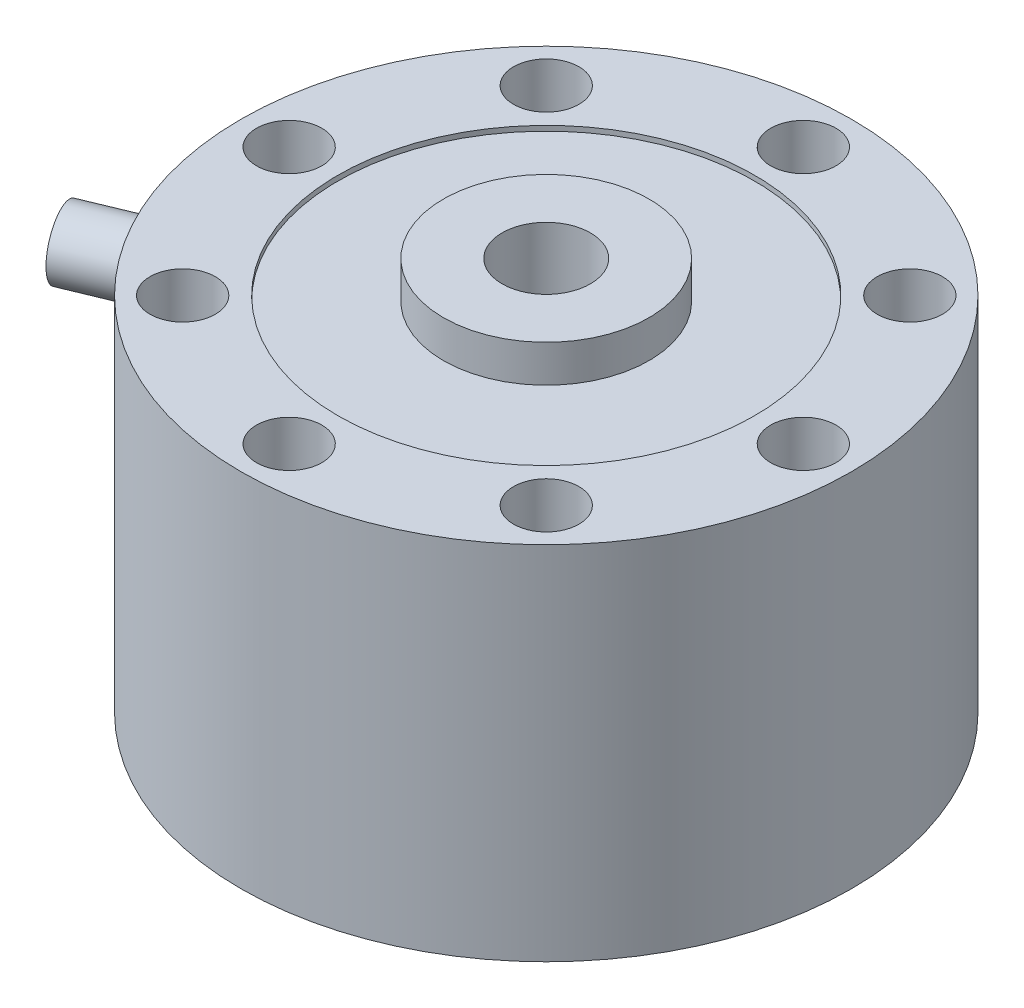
ISO-10303-21;
HEADER;
FILE_DESCRIPTION(('STEP AP214'),'2;1');
FILE_NAME('part.step','',(''),(''),'','','');
FILE_SCHEMA(('AUTOMOTIVE_DESIGN { 1 0 10303 214 1 1 1 1 }'));
ENDSEC;
DATA;
#1=APPLICATION_CONTEXT('core data for automotive mechanical design processes');
#2=APPLICATION_PROTOCOL_DEFINITION('international standard','automotive_design',2000,#1);
#3=PRODUCT_CONTEXT('',#1,'mechanical');
#4=PRODUCT('Part','Part','',(#3));
#5=PRODUCT_RELATED_PRODUCT_CATEGORY('part','',(#4));
#6=PRODUCT_DEFINITION_FORMATION('','',#4);
#7=PRODUCT_DEFINITION_CONTEXT('part definition',#1,'design');
#8=PRODUCT_DEFINITION('design','',#6,#7);
#9=PRODUCT_DEFINITION_SHAPE('','',#8);
#10=(LENGTH_UNIT() NAMED_UNIT(*) SI_UNIT(.MILLI.,.METRE.));
#11=(NAMED_UNIT(*) PLANE_ANGLE_UNIT() SI_UNIT($,.RADIAN.));
#12=(NAMED_UNIT(*) SI_UNIT($,.STERADIAN.) SOLID_ANGLE_UNIT());
#13=UNCERTAINTY_MEASURE_WITH_UNIT(LENGTH_MEASURE(1.E-05),#10,'distance_accuracy_value','');
#14=(GEOMETRIC_REPRESENTATION_CONTEXT(3) GLOBAL_UNCERTAINTY_ASSIGNED_CONTEXT((#13)) GLOBAL_UNIT_ASSIGNED_CONTEXT((#10,
#11,#12)) REPRESENTATION_CONTEXT('',''));
#15=CARTESIAN_POINT('',(0.,0.,0.));
#16=DIRECTION('',(0.,0.,1.));
#17=DIRECTION('',(1.,0.,0.));
#18=AXIS2_PLACEMENT_3D('',#15,#16,#17);
#19=CARTESIAN_POINT('',(0.,71.374,0.));
#20=DIRECTION('',(0.,-1.,0.));
#21=DIRECTION('',(0.,0.,-1.));
#22=AXIS2_PLACEMENT_3D('',#19,#20,#21);
#23=CYLINDRICAL_SURFACE('',#22,60.325);
#24=CARTESIAN_POINT('',(0.,71.374,0.));
#25=DIRECTION('',(0.,1.,0.));
#26=DIRECTION('',(0.,0.,1.));
#27=AXIS2_PLACEMENT_3D('',#24,#25,#26);
#28=CIRCLE('',#27,60.325);
#29=CARTESIAN_POINT('',(0.,71.374,60.325));
#30=VERTEX_POINT('',#29);
#31=EDGE_CURVE('E84',#30,#30,#28,.T.);
#32=ORIENTED_EDGE('',*,*,#31,.F.);
#33=EDGE_LOOP('',(#32));
#34=FACE_BOUND('',#33,.T.);
#35=CARTESIAN_POINT('',(0.,0.,0.));
#36=DIRECTION('',(0.,1.,0.));
#37=DIRECTION('',(0.,0.,1.));
#38=AXIS2_PLACEMENT_3D('',#35,#36,#37);
#39=CIRCLE('',#38,60.325);
#40=CARTESIAN_POINT('',(0.,0.,60.325));
#41=VERTEX_POINT('',#40);
#42=EDGE_CURVE('E83',#41,#41,#39,.T.);
#43=ORIENTED_EDGE('',*,*,#42,.T.);
#44=EDGE_LOOP('',(#43));
#45=FACE_BOUND('',#44,.T.);
#46=CARTESIAN_POINT('',(-57.853442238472,60.718554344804,17.0904899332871));
#47=CARTESIAN_POINT('',(-57.8534424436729,60.5406812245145,17.090488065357));
#48=CARTESIAN_POINT('',(-57.8513134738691,60.3628354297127,17.097700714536));
#49=CARTESIAN_POINT('',(-57.8427971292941,60.008356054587,17.1264906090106));
#50=CARTESIAN_POINT('',(-57.8364087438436,59.8317227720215,17.1480712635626));
#51=CARTESIAN_POINT('',(-57.819366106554,59.480849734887,17.2054473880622));
#52=CARTESIAN_POINT('',(-57.808708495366,59.3066119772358,17.241254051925));
#53=CARTESIAN_POINT('',(-57.7831247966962,58.9618431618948,17.3268031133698));
#54=CARTESIAN_POINT('',(-57.7681971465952,58.7913134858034,17.3765506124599));
#55=CARTESIAN_POINT('',(-57.7340971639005,58.4554030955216,17.4895146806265));
#56=CARTESIAN_POINT('',(-57.7149290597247,58.2900174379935,17.5527178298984));
#57=CARTESIAN_POINT('',(-57.6723427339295,57.9653209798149,17.6921400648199));
#58=CARTESIAN_POINT('',(-57.6489229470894,57.806012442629,17.7683639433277));
#59=CARTESIAN_POINT('',(-57.5978721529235,57.494739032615,17.9331587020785));
#60=CARTESIAN_POINT('',(-57.570243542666,57.3427700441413,18.0217225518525));
#61=CARTESIAN_POINT('',(-57.5107863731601,57.047083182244,18.2105704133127));
#62=CARTESIAN_POINT('',(-57.4789562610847,56.9033683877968,18.3108587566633));
#63=CARTESIAN_POINT('',(-57.4110437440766,56.624804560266,18.5226911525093));
#64=CARTESIAN_POINT('',(-57.3749480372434,56.4899854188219,18.634270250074));
#65=CARTESIAN_POINT('',(-57.29864274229,56.2306146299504,18.8675974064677));
#66=CARTESIAN_POINT('',(-57.2584316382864,56.1060667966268,18.9893492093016));
#67=CARTESIAN_POINT('',(-57.1740169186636,55.8682066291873,19.2420151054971));
#68=CARTESIAN_POINT('',(-57.1298145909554,55.7548906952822,19.3729262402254));
#69=CARTESIAN_POINT('',(-57.0375175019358,55.540207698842,19.6430036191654));
#70=CARTESIAN_POINT('',(-56.9894213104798,55.4388450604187,19.782172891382));
#71=CARTESIAN_POINT('',(-56.8894161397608,55.2486495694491,20.0679573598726));
#72=CARTESIAN_POINT('',(-56.8374998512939,55.159841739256,20.2145866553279));
#73=CARTESIAN_POINT('',(-56.7301262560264,54.9956004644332,20.5139880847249));
#74=CARTESIAN_POINT('',(-56.6746676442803,54.9201719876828,20.6667624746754));
#75=CARTESIAN_POINT('',(-56.5604931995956,54.7833030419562,20.9772148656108));
#76=CARTESIAN_POINT('',(-56.5017786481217,54.721857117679,21.1348909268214));
#77=CARTESIAN_POINT('',(-56.3813746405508,54.6133466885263,21.4540302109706));
#78=CARTESIAN_POINT('',(-56.3196840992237,54.566287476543,21.6154948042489));
#79=CARTESIAN_POINT('',(-56.1311619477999,54.4476193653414,22.1024535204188));
#80=CARTESIAN_POINT('',(-56.0003259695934,54.3978559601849,22.4320242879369));
#81=CARTESIAN_POINT('',(-55.7315722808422,54.3585339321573,23.091655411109));
#82=CARTESIAN_POINT('',(-55.5936547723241,54.3689735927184,23.4217157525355));
#83=CARTESIAN_POINT('',(-55.3152468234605,54.4495044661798,24.0718422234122));
#84=CARTESIAN_POINT('',(-55.174768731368,54.5193593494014,24.3919427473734));
#85=CARTESIAN_POINT('',(-54.8952635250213,54.7163903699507,25.0146408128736));
#86=CARTESIAN_POINT('',(-54.7562364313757,54.843567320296,25.3172381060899));
#87=CARTESIAN_POINT('',(-54.4842323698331,55.1518844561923,25.897432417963));
#88=CARTESIAN_POINT('',(-54.3512676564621,55.3331288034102,26.1749798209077));
#89=CARTESIAN_POINT('',(-54.0966622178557,55.7443617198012,26.6972151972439));
#90=CARTESIAN_POINT('',(-53.9750218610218,55.9743518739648,26.9419021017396));
#91=CARTESIAN_POINT('',(-53.7473390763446,56.4778758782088,27.3933116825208));
#92=CARTESIAN_POINT('',(-53.6413751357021,56.7516154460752,27.5998445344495));
#93=CARTESIAN_POINT('',(-53.4502151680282,57.3341559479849,27.9682559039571));
#94=CARTESIAN_POINT('',(-53.3650191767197,57.6429569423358,28.1301343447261));
#95=CARTESIAN_POINT('',(-53.2191257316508,58.2870172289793,28.4051869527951));
#96=CARTESIAN_POINT('',(-53.1584343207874,58.6222830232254,28.51834910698));
#97=CARTESIAN_POINT('',(-53.0643557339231,59.3096746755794,28.6930254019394));
#98=CARTESIAN_POINT('',(-53.0309676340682,59.661799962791,28.7545412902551));
#99=CARTESIAN_POINT('',(-52.9931476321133,60.3711096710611,28.824182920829));
#100=CARTESIAN_POINT('',(-52.9885778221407,60.7282617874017,28.8325629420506));
#101=CARTESIAN_POINT('',(-53.008240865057,61.4390712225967,28.7963961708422));
#102=CARTESIAN_POINT('',(-53.0324732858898,61.7927285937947,28.751850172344));
#103=CARTESIAN_POINT('',(-53.1085194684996,62.4856663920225,28.6111357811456));
#104=CARTESIAN_POINT('',(-53.1602685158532,62.8249785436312,28.5150885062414));
#105=CARTESIAN_POINT('',(-53.2889546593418,63.4805814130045,28.273866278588));
#106=CARTESIAN_POINT('',(-53.3658923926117,63.7968715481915,28.1286900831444));
#107=CARTESIAN_POINT('',(-53.5419048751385,64.3987615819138,27.7921949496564));
#108=CARTESIAN_POINT('',(-53.641061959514,64.6842413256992,27.6007041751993));
#109=CARTESIAN_POINT('',(-53.8571365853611,65.2151868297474,27.1766616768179));
#110=CARTESIAN_POINT('',(-53.9740546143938,65.4606514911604,26.9441088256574));
#111=CARTESIAN_POINT('',(-54.2214116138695,65.9055951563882,26.4428145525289));
#112=CARTESIAN_POINT('',(-54.3519028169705,66.1048862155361,26.1739320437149));
#113=CARTESIAN_POINT('',(-54.6209722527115,66.4505290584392,25.6076766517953));
#114=CARTESIAN_POINT('',(-54.7595503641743,66.596881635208,25.310304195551));
#115=CARTESIAN_POINT('',(-55.0394552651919,66.832182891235,24.6957040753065));
#116=CARTESIAN_POINT('',(-55.1807760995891,66.9212441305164,24.3785166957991));
#117=CARTESIAN_POINT('',(-55.4617710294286,67.0397768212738,23.7322852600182));
#118=CARTESIAN_POINT('',(-55.6014451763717,67.0692501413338,23.4032415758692));
#119=CARTESIAN_POINT('',(-55.8060248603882,67.0681878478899,22.9090630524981));
#120=CARTESIAN_POINT('',(-55.873273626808,67.0603456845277,22.7445463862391));
#121=CARTESIAN_POINT('',(-56.0058369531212,67.0297929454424,22.4161346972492));
#122=CARTESIAN_POINT('',(-56.071152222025,67.007087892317,22.2522394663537));
#123=CARTESIAN_POINT('',(-56.1994532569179,66.9469579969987,21.9261901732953));
#124=CARTESIAN_POINT('',(-56.2624381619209,66.9095277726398,21.764036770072));
#125=CARTESIAN_POINT('',(-56.3856666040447,66.8202408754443,21.4427565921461));
#126=CARTESIAN_POINT('',(-56.4459111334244,66.7683894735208,21.283628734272));
#127=CARTESIAN_POINT('',(-56.563369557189,66.6506182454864,20.9694773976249));
#128=CARTESIAN_POINT('',(-56.6205828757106,66.5846957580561,20.8144547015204));
#129=CARTESIAN_POINT('',(-56.7316709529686,66.4392890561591,20.5097398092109));
#130=CARTESIAN_POINT('',(-56.7855469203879,66.3598097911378,20.3600456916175));
#131=CARTESIAN_POINT('',(-56.8897712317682,66.1878081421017,20.0669816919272));
#132=CARTESIAN_POINT('',(-56.9401183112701,66.0952811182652,19.9236140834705));
#133=CARTESIAN_POINT('',(-57.0370579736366,65.8978951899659,19.6443753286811));
#134=CARTESIAN_POINT('',(-57.0836519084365,65.7930407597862,19.5085014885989));
#135=CARTESIAN_POINT('',(-57.1731804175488,65.5711517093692,19.2445470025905));
#136=CARTESIAN_POINT('',(-57.2160954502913,65.4540585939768,19.1165088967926));
#137=CARTESIAN_POINT('',(-57.2978704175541,65.2090001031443,18.8699902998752));
#138=CARTESIAN_POINT('',(-57.3367318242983,65.0810387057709,18.7515063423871));
#139=CARTESIAN_POINT('',(-57.4103524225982,64.8150222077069,18.524882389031));
#140=CARTESIAN_POINT('',(-57.4451091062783,64.6769610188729,18.4167487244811));
#141=CARTESIAN_POINT('',(-57.5104177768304,64.3918339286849,18.2117830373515));
#142=CARTESIAN_POINT('',(-57.5409713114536,64.2447713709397,18.1149468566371));
#143=CARTESIAN_POINT('',(-57.5979360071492,63.9421466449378,17.933000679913));
#144=CARTESIAN_POINT('',(-57.6243337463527,63.7865590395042,17.8479287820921));
#145=CARTESIAN_POINT('',(-57.6728328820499,63.4684724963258,17.6905836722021));
#146=CARTESIAN_POINT('',(-57.6949358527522,63.305976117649,17.6183057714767));
#147=CARTESIAN_POINT('',(-57.7348249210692,62.9753021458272,17.4871471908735));
#148=CARTESIAN_POINT('',(-57.7526145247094,62.8071292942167,17.4282556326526));
#149=CARTESIAN_POINT('',(-57.7838866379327,62.4662348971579,17.32428958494));
#150=CARTESIAN_POINT('',(-57.7973701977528,62.2935144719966,17.2792117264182));
#151=CARTESIAN_POINT('',(-57.8236128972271,61.8895914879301,17.1912241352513));
#152=CARTESIAN_POINT('',(-57.834799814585,61.6571387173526,17.1534905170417));
#153=CARTESIAN_POINT('',(-57.8497143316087,61.1892927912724,17.1031247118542));
#154=CARTESIAN_POINT('',(-57.853441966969,60.9538996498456,17.09049240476));
#155=CARTESIAN_POINT('',(-57.853442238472,60.718554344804,17.0904899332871));
#156=B_SPLINE_CURVE_WITH_KNOTS('',3,(#46,#47,#48,#49,#50,#51,#52,#53,#54,#55,#56,#57,#58,#59,
#60,#61,#62,#63,#64,#65,#66,#67,#68,#69,#70,#71,#72,#73,#74,#75,#76,#77,#78,#79,#80,#81,#82,#83,
#84,#85,#86,#87,#88,#89,#90,#91,#92,#93,#94,#95,#96,#97,#98,#99,#100,#101,#102,#103,#104,#105,
#106,#107,#108,#109,#110,#111,#112,#113,#114,#115,#116,#117,#118,#119,#120,#121,#122,#123,#124,
#125,#126,#127,#128,#129,#130,#131,#132,#133,#134,#135,#136,#137,#138,#139,#140,#141,#142,#143,
#144,#145,#146,#147,#148,#149,#150,#151,#152,#153,#154,#155),.UNSPECIFIED.,.T.,.F.,(4,2,2,2,2,2,
2,2,2,2,2,2,2,2,2,2,2,2,2,2,2,2,2,2,2,2,2,2,2,2,2,2,2,2,2,2,2,2,2,2,2,2,2,2,2,2,2,2,2,2,2,2,2,2,
4),(0.,0.533413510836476,1.06695363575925,1.60091441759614,2.1350708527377,2.66869702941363,
3.20252005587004,3.73604018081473,4.26975804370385,4.80518650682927,5.34081290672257,
5.8762670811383,6.41191881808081,6.94862352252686,7.48552709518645,8.02222083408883,
8.55911178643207,9.62773556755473,10.6963288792,11.7606915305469,12.8250692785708,
13.8915109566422,14.9579873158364,16.0296345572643,17.1012836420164,18.1731968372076,
19.2450737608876,20.3118173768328,21.3785449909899,22.4427748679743,23.5070316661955,
24.57529933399,25.6435963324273,26.71616818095,27.7887239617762,28.8591660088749,
29.929574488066,30.4627659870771,30.9957594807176,31.528947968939,32.0619418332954,
32.5950365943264,33.1279371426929,33.661027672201,34.1939253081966,34.7294977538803,
35.2648750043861,35.8005776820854,36.3360825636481,36.873282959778,37.4102860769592,
37.9468512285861,38.4832854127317,39.1890523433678,39.8948158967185),.UNSPECIFIED.);
#157=CARTESIAN_POINT('',(-57.853442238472,60.718554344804,17.0904899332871));
#158=VERTEX_POINT('',#157);
#159=EDGE_CURVE('E11',#158,#158,#156,.T.);
#160=ORIENTED_EDGE('',*,*,#159,.F.);
#161=EDGE_LOOP('',(#160));
#162=FACE_BOUND('',#161,.T.);
#163=ADVANCED_FACE('F37',(#34,#45,#162),#23,.T.);
#164=CARTESIAN_POINT('',(-35.9210244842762,-1.27000000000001,-35.9210244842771));
#165=DIRECTION('',(0.,1.,0.));
#166=DIRECTION('',(0.,0.,1.));
#167=AXIS2_PLACEMENT_3D('',#164,#165,#166);
#168=CYLINDRICAL_SURFACE('',#167,4.3561);
#169=CARTESIAN_POINT('',(-35.9210244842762,0.,-35.9210244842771));
#170=DIRECTION('',(0.,1.,0.));
#171=DIRECTION('',(0.,0.,1.));
#172=AXIS2_PLACEMENT_3D('',#169,#170,#171);
#173=CIRCLE('',#172,4.3561);
#174=CARTESIAN_POINT('',(-35.9210244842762,0.,-31.564924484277));
#175=VERTEX_POINT('',#174);
#176=EDGE_CURVE('E98',#175,#175,#173,.T.);
#177=ORIENTED_EDGE('',*,*,#176,.F.);
#178=EDGE_LOOP('',(#177));
#179=FACE_BOUND('',#178,.T.);
#180=CARTESIAN_POINT('',(-35.9210244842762,61.214,-35.9210244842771));
#181=DIRECTION('',(0.,1.,0.));
#182=DIRECTION('',(0.,0.,1.));
#183=AXIS2_PLACEMENT_3D('',#180,#181,#182);
#184=CIRCLE('',#183,4.3561);
#185=CARTESIAN_POINT('',(-35.9210244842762,61.214,-31.564924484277));
#186=VERTEX_POINT('',#185);
#187=EDGE_CURVE('E115',#186,#186,#184,.F.);
#188=ORIENTED_EDGE('',*,*,#187,.F.);
#189=EDGE_LOOP('',(#188));
#190=FACE_BOUND('',#189,.T.);
#191=ADVANCED_FACE('F180',(#179,#190),#168,.F.);
#192=CARTESIAN_POINT('',(-50.8,-1.27000000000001,-5.32101756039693E-13));
#193=DIRECTION('',(0.,1.,0.));
#194=DIRECTION('',(0.,0.,1.));
#195=AXIS2_PLACEMENT_3D('',#192,#193,#194);
#196=CYLINDRICAL_SURFACE('',#195,4.3561);
#197=CARTESIAN_POINT('',(-50.8,0.,-5.32101756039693E-13));
#198=DIRECTION('',(0.,1.,0.));
#199=DIRECTION('',(0.,0.,1.));
#200=AXIS2_PLACEMENT_3D('',#197,#198,#199);
#201=CIRCLE('',#200,4.3561);
#202=CARTESIAN_POINT('',(-50.8,0.,4.35609999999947));
#203=VERTEX_POINT('',#202);
#204=EDGE_CURVE('E130',#203,#203,#201,.T.);
#205=ORIENTED_EDGE('',*,*,#204,.F.);
#206=EDGE_LOOP('',(#205));
#207=FACE_BOUND('',#206,.T.);
#208=CARTESIAN_POINT('',(-50.8,61.214,-5.32101756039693E-13));
#209=DIRECTION('',(0.,1.,0.));
#210=DIRECTION('',(0.,0.,1.));
#211=AXIS2_PLACEMENT_3D('',#208,#209,#210);
#212=CIRCLE('',#211,4.3561);
#213=CARTESIAN_POINT('',(-50.8,61.214,4.35609999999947));
#214=VERTEX_POINT('',#213);
#215=EDGE_CURVE('E113',#214,#214,#212,.F.);
#216=ORIENTED_EDGE('',*,*,#215,.F.);
#217=EDGE_LOOP('',(#216));
#218=FACE_BOUND('',#217,.T.);
#219=ADVANCED_FACE('F185',(#207,#218),#196,.F.);
#220=CARTESIAN_POINT('',(-35.9210244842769,-1.27000000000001,35.9210244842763));
#221=DIRECTION('',(0.,1.,0.));
#222=DIRECTION('',(0.,0.,1.));
#223=AXIS2_PLACEMENT_3D('',#220,#221,#222);
#224=CYLINDRICAL_SURFACE('',#223,4.3561);
#225=CARTESIAN_POINT('',(-35.9210244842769,0.,35.9210244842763));
#226=DIRECTION('',(0.,1.,0.));
#227=DIRECTION('',(0.,0.,1.));
#228=AXIS2_PLACEMENT_3D('',#225,#226,#227);
#229=CIRCLE('',#228,4.3561);
#230=CARTESIAN_POINT('',(-35.9210244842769,0.,40.2771244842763));
#231=VERTEX_POINT('',#230);
#232=EDGE_CURVE('E133',#231,#231,#229,.T.);
#233=ORIENTED_EDGE('',*,*,#232,.F.);
#234=EDGE_LOOP('',(#233));
#235=FACE_BOUND('',#234,.T.);
#236=CARTESIAN_POINT('',(-35.9210244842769,61.214,35.9210244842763));
#237=DIRECTION('',(0.,1.,0.));
#238=DIRECTION('',(0.,0.,1.));
#239=AXIS2_PLACEMENT_3D('',#236,#237,#238);
#240=CIRCLE('',#239,4.3561);
#241=CARTESIAN_POINT('',(-35.9210244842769,61.214,40.2771244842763));
#242=VERTEX_POINT('',#241);
#243=EDGE_CURVE('E110',#242,#242,#240,.F.);
#244=ORIENTED_EDGE('',*,*,#243,.F.);
#245=EDGE_LOOP('',(#244));
#246=FACE_BOUND('',#245,.T.);
#247=ADVANCED_FACE('F286',(#235,#246),#224,.F.);
#248=CARTESIAN_POINT('',(0.,-1.27000000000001,50.8));
#249=DIRECTION('',(0.,1.,0.));
#250=DIRECTION('',(0.,0.,1.));
#251=AXIS2_PLACEMENT_3D('',#248,#249,#250);
#252=CYLINDRICAL_SURFACE('',#251,4.3561);
#253=CARTESIAN_POINT('',(0.,0.,50.8));
#254=DIRECTION('',(0.,1.,0.));
#255=DIRECTION('',(0.,0.,1.));
#256=AXIS2_PLACEMENT_3D('',#253,#254,#255);
#257=CIRCLE('',#256,4.3561);
#258=CARTESIAN_POINT('',(0.,0.,55.1561));
#259=VERTEX_POINT('',#258);
#260=EDGE_CURVE('E136',#259,#259,#257,.T.);
#261=ORIENTED_EDGE('',*,*,#260,.F.);
#262=EDGE_LOOP('',(#261));
#263=FACE_BOUND('',#262,.T.);
#264=CARTESIAN_POINT('',(0.,61.214,50.8));
#265=DIRECTION('',(0.,1.,0.));
#266=DIRECTION('',(0.,0.,1.));
#267=AXIS2_PLACEMENT_3D('',#264,#265,#266);
#268=CIRCLE('',#267,4.3561);
#269=CARTESIAN_POINT('',(0.,61.214,55.1561));
#270=VERTEX_POINT('',#269);
#271=EDGE_CURVE('E107',#270,#270,#268,.F.);
#272=ORIENTED_EDGE('',*,*,#271,.F.);
#273=EDGE_LOOP('',(#272));
#274=FACE_BOUND('',#273,.T.);
#275=ADVANCED_FACE('F282',(#263,#274),#252,.F.);
#276=CARTESIAN_POINT('',(35.9210244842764,-1.27000000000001,35.9210244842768));
#277=DIRECTION('',(0.,1.,0.));
#278=DIRECTION('',(0.,0.,1.));
#279=AXIS2_PLACEMENT_3D('',#276,#277,#278);
#280=CYLINDRICAL_SURFACE('',#279,4.3561);
#281=CARTESIAN_POINT('',(35.9210244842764,0.,35.9210244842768));
#282=DIRECTION('',(0.,1.,0.));
#283=DIRECTION('',(0.,0.,1.));
#284=AXIS2_PLACEMENT_3D('',#281,#282,#283);
#285=CIRCLE('',#284,4.3561);
#286=CARTESIAN_POINT('',(35.9210244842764,0.,40.2771244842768));
#287=VERTEX_POINT('',#286);
#288=EDGE_CURVE('E139',#287,#287,#285,.T.);
#289=ORIENTED_EDGE('',*,*,#288,.F.);
#290=EDGE_LOOP('',(#289));
#291=FACE_BOUND('',#290,.T.);
#292=CARTESIAN_POINT('',(35.9210244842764,61.214,35.9210244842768));
#293=DIRECTION('',(0.,1.,0.));
#294=DIRECTION('',(0.,0.,1.));
#295=AXIS2_PLACEMENT_3D('',#292,#293,#294);
#296=CIRCLE('',#295,4.3561);
#297=CARTESIAN_POINT('',(35.9210244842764,61.214,40.2771244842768));
#298=VERTEX_POINT('',#297);
#299=EDGE_CURVE('E103',#298,#298,#296,.F.);
#300=ORIENTED_EDGE('',*,*,#299,.F.);
#301=EDGE_LOOP('',(#300));
#302=FACE_BOUND('',#301,.T.);
#303=ADVANCED_FACE('F278',(#291,#302),#280,.F.);
#304=CARTESIAN_POINT('',(50.8,-1.27000000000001,1.77367252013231E-13));
#305=DIRECTION('',(0.,1.,0.));
#306=DIRECTION('',(0.,0.,1.));
#307=AXIS2_PLACEMENT_3D('',#304,#305,#306);
#308=CYLINDRICAL_SURFACE('',#307,4.3561);
#309=CARTESIAN_POINT('',(50.8,0.,1.77367252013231E-13));
#310=DIRECTION('',(0.,1.,0.));
#311=DIRECTION('',(0.,0.,1.));
#312=AXIS2_PLACEMENT_3D('',#309,#310,#311);
#313=CIRCLE('',#312,4.3561);
#314=CARTESIAN_POINT('',(50.8,0.,4.35610000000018));
#315=VERTEX_POINT('',#314);
#316=EDGE_CURVE('E142',#315,#315,#313,.T.);
#317=ORIENTED_EDGE('',*,*,#316,.F.);
#318=EDGE_LOOP('',(#317));
#319=FACE_BOUND('',#318,.T.);
#320=CARTESIAN_POINT('',(50.8,61.214,1.77367252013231E-13));
#321=DIRECTION('',(0.,1.,0.));
#322=DIRECTION('',(0.,0.,1.));
#323=AXIS2_PLACEMENT_3D('',#320,#321,#322);
#324=CIRCLE('',#323,4.3561);
#325=CARTESIAN_POINT('',(50.8,61.214,4.35610000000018));
#326=VERTEX_POINT('',#325);
#327=EDGE_CURVE('E100',#326,#326,#324,.F.);
#328=ORIENTED_EDGE('',*,*,#327,.F.);
#329=EDGE_LOOP('',(#328));
#330=FACE_BOUND('',#329,.T.);
#331=ADVANCED_FACE('F275',(#319,#330),#308,.F.);
#332=CARTESIAN_POINT('',(35.9210244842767,-1.27000000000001,-35.9210244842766));
#333=DIRECTION('',(0.,1.,0.));
#334=DIRECTION('',(0.,0.,1.));
#335=AXIS2_PLACEMENT_3D('',#332,#333,#334);
#336=CYLINDRICAL_SURFACE('',#335,4.3561);
#337=CARTESIAN_POINT('',(35.9210244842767,0.,-35.9210244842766));
#338=DIRECTION('',(0.,1.,0.));
#339=DIRECTION('',(0.,0.,1.));
#340=AXIS2_PLACEMENT_3D('',#337,#338,#339);
#341=CIRCLE('',#340,4.3561);
#342=CARTESIAN_POINT('',(35.9210244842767,0.,-31.5649244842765));
#343=VERTEX_POINT('',#342);
#344=EDGE_CURVE('E145',#343,#343,#341,.T.);
#345=ORIENTED_EDGE('',*,*,#344,.F.);
#346=EDGE_LOOP('',(#345));
#347=FACE_BOUND('',#346,.T.);
#348=CARTESIAN_POINT('',(35.9210244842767,61.214,-35.9210244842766));
#349=DIRECTION('',(0.,1.,0.));
#350=DIRECTION('',(0.,0.,1.));
#351=AXIS2_PLACEMENT_3D('',#348,#349,#350);
#352=CIRCLE('',#351,4.3561);
#353=CARTESIAN_POINT('',(35.9210244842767,61.214,-31.5649244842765));
#354=VERTEX_POINT('',#353);
#355=EDGE_CURVE('E95',#354,#354,#352,.F.);
#356=ORIENTED_EDGE('',*,*,#355,.F.);
#357=EDGE_LOOP('',(#356));
#358=FACE_BOUND('',#357,.T.);
#359=ADVANCED_FACE('F161',(#347,#358),#336,.F.);
#360=CARTESIAN_POINT('',(0.,-1.27000000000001,-50.8));
#361=DIRECTION('',(0.,1.,0.));
#362=DIRECTION('',(0.,0.,1.));
#363=AXIS2_PLACEMENT_3D('',#360,#361,#362);
#364=CYLINDRICAL_SURFACE('',#363,4.3561);
#365=CARTESIAN_POINT('',(0.,0.,-50.8));
#366=DIRECTION('',(0.,1.,0.));
#367=DIRECTION('',(0.,0.,1.));
#368=AXIS2_PLACEMENT_3D('',#365,#366,#367);
#369=CIRCLE('',#368,4.3561);
#370=CARTESIAN_POINT('',(0.,0.,-46.4439));
#371=VERTEX_POINT('',#370);
#372=EDGE_CURVE('E71',#371,#371,#369,.T.);
#373=ORIENTED_EDGE('',*,*,#372,.F.);
#374=EDGE_LOOP('',(#373));
#375=FACE_BOUND('',#374,.T.);
#376=CARTESIAN_POINT('',(0.,61.214,-50.8));
#377=DIRECTION('',(0.,1.,0.));
#378=DIRECTION('',(0.,0.,1.));
#379=AXIS2_PLACEMENT_3D('',#376,#377,#378);
#380=CIRCLE('',#379,4.3561);
#381=CARTESIAN_POINT('',(0.,61.214,-46.4439));
#382=VERTEX_POINT('',#381);
#383=EDGE_CURVE('E91',#382,#382,#380,.F.);
#384=ORIENTED_EDGE('',*,*,#383,.F.);
#385=EDGE_LOOP('',(#384));
#386=FACE_BOUND('',#385,.T.);
#387=ADVANCED_FACE('F158',(#375,#386),#364,.F.);
#388=CARTESIAN_POINT('',(0.,0.,0.));
#389=DIRECTION('',(0.,1.,0.));
#390=DIRECTION('',(0.,0.,1.));
#391=AXIS2_PLACEMENT_3D('',#388,#389,#390);
#392=PLANE('',#391);
#393=ORIENTED_EDGE('',*,*,#316,.T.);
#394=EDGE_LOOP('',(#393));
#395=FACE_BOUND('',#394,.T.);
#396=ORIENTED_EDGE('',*,*,#288,.T.);
#397=EDGE_LOOP('',(#396));
#398=FACE_BOUND('',#397,.T.);
#399=ORIENTED_EDGE('',*,*,#260,.T.);
#400=EDGE_LOOP('',(#399));
#401=FACE_BOUND('',#400,.T.);
#402=ORIENTED_EDGE('',*,*,#232,.T.);
#403=EDGE_LOOP('',(#402));
#404=FACE_BOUND('',#403,.T.);
#405=ORIENTED_EDGE('',*,*,#204,.T.);
#406=EDGE_LOOP('',(#405));
#407=FACE_BOUND('',#406,.T.);
#408=ORIENTED_EDGE('',*,*,#176,.T.);
#409=EDGE_LOOP('',(#408));
#410=FACE_BOUND('',#409,.T.);
#411=ORIENTED_EDGE('',*,*,#344,.T.);
#412=EDGE_LOOP('',(#411));
#413=FACE_BOUND('',#412,.T.);
#414=ORIENTED_EDGE('',*,*,#372,.T.);
#415=EDGE_LOOP('',(#414));
#416=FACE_BOUND('',#415,.T.);
#417=ORIENTED_EDGE('',*,*,#42,.F.);
#418=EDGE_LOOP('',(#417));
#419=FACE_BOUND('',#418,.T.);
#420=CARTESIAN_POINT('',(0.,0.,0.));
#421=DIRECTION('',(0.,1.,0.));
#422=DIRECTION('',(0.,0.,1.));
#423=AXIS2_PLACEMENT_3D('',#420,#421,#422);
#424=CIRCLE('',#423,20.32);
#425=CARTESIAN_POINT('',(0.,0.,20.32));
#426=VERTEX_POINT('',#425);
#427=EDGE_CURVE('E48',#426,#426,#424,.F.);
#428=ORIENTED_EDGE('',*,*,#427,.F.);
#429=EDGE_LOOP('',(#428));
#430=FACE_BOUND('',#429,.T.);
#431=ADVANCED_FACE('F155',(#395,#398,#401,#404,#407,#410,#413,#416,#419,#430),#392,.F.);
#432=CARTESIAN_POINT('',(0.,71.374,0.));
#433=DIRECTION('',(0.,1.,0.));
#434=DIRECTION('',(0.,0.,1.));
#435=AXIS2_PLACEMENT_3D('',#432,#433,#434);
#436=PLANE('',#435);
#437=CARTESIAN_POINT('',(0.,71.374,0.));
#438=DIRECTION('',(0.,1.,0.));
#439=DIRECTION('',(0.,0.,1.));
#440=AXIS2_PLACEMENT_3D('',#437,#438,#439);
#441=CIRCLE('',#440,41.1700045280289);
#442=CARTESIAN_POINT('',(0.,71.374,41.1700045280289));
#443=VERTEX_POINT('',#442);
#444=EDGE_CURVE('E338',#443,#443,#441,.T.);
#445=ORIENTED_EDGE('',*,*,#444,.F.);
#446=EDGE_LOOP('',(#445));
#447=FACE_BOUND('',#446,.T.);
#448=CARTESIAN_POINT('',(50.8,71.374,1.77367252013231E-13));
#449=DIRECTION('',(0.,1.,0.));
#450=DIRECTION('',(-1.,0.,0.));
#451=AXIS2_PLACEMENT_3D('',#448,#449,#450);
#452=CIRCLE('',#451,6.4516);
#453=CARTESIAN_POINT('',(44.3484,71.374,1.54841611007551E-13));
#454=VERTEX_POINT('',#453);
#455=EDGE_CURVE('E352',#454,#454,#452,.T.);
#456=ORIENTED_EDGE('',*,*,#455,.F.);
#457=EDGE_LOOP('',(#456));
#458=FACE_BOUND('',#457,.T.);
#459=CARTESIAN_POINT('',(35.9210244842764,71.374,35.9210244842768));
#460=DIRECTION('',(0.,1.,0.));
#461=DIRECTION('',(-0.707106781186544,0.,-0.707106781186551));
#462=AXIS2_PLACEMENT_3D('',#459,#460,#461);
#463=CIRCLE('',#462,6.4516);
#464=CARTESIAN_POINT('',(31.3590543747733,71.374,31.3590543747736));
#465=VERTEX_POINT('',#464);
#466=EDGE_CURVE('E358',#465,#465,#463,.T.);
#467=ORIENTED_EDGE('',*,*,#466,.F.);
#468=EDGE_LOOP('',(#467));
#469=FACE_BOUND('',#468,.T.);
#470=CARTESIAN_POINT('',(0.,71.374,50.8));
#471=DIRECTION('',(0.,1.,0.));
#472=DIRECTION('',(0.,0.,-1.));
#473=AXIS2_PLACEMENT_3D('',#470,#471,#472);
#474=CIRCLE('',#473,6.4516);
#475=CARTESIAN_POINT('',(0.,71.374,44.3484));
#476=VERTEX_POINT('',#475);
#477=EDGE_CURVE('E364',#476,#476,#474,.T.);
#478=ORIENTED_EDGE('',*,*,#477,.F.);
#479=EDGE_LOOP('',(#478));
#480=FACE_BOUND('',#479,.T.);
#481=CARTESIAN_POINT('',(-35.9210244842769,71.374,35.9210244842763));
#482=DIRECTION('',(0.,1.,0.));
#483=DIRECTION('',(0.707106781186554,0.,-0.707106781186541));
#484=AXIS2_PLACEMENT_3D('',#481,#482,#483);
#485=CIRCLE('',#484,6.4516);
#486=CARTESIAN_POINT('',(-31.3590543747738,71.374,31.3590543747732));
#487=VERTEX_POINT('',#486);
#488=EDGE_CURVE('E370',#487,#487,#485,.T.);
#489=ORIENTED_EDGE('',*,*,#488,.F.);
#490=EDGE_LOOP('',(#489));
#491=FACE_BOUND('',#490,.T.);
#492=CARTESIAN_POINT('',(-50.8,71.374,-5.32101756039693E-13));
#493=DIRECTION('',(0.,1.,0.));
#494=DIRECTION('',(1.,0.,0.));
#495=AXIS2_PLACEMENT_3D('',#492,#493,#494);
#496=CIRCLE('',#495,6.4516);
#497=CARTESIAN_POINT('',(-44.3484,71.374,-4.64524833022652E-13));
#498=VERTEX_POINT('',#497);
#499=EDGE_CURVE('E376',#498,#498,#496,.T.);
#500=ORIENTED_EDGE('',*,*,#499,.F.);
#501=EDGE_LOOP('',(#500));
#502=FACE_BOUND('',#501,.T.);
#503=CARTESIAN_POINT('',(-35.9210244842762,71.374,-35.9210244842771));
#504=DIRECTION('',(0.,1.,0.));
#505=DIRECTION('',(0.707106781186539,0.,0.707106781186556));
#506=AXIS2_PLACEMENT_3D('',#503,#504,#505);
#507=CIRCLE('',#506,6.4516);
#508=CARTESIAN_POINT('',(-31.3590543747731,71.374,-31.3590543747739));
#509=VERTEX_POINT('',#508);
#510=EDGE_CURVE('E348',#509,#509,#507,.T.);
#511=ORIENTED_EDGE('',*,*,#510,.F.);
#512=EDGE_LOOP('',(#511));
#513=FACE_BOUND('',#512,.T.);
#514=CARTESIAN_POINT('',(35.9210244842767,71.374,-35.9210244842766));
#515=DIRECTION('',(0.,1.,0.));
#516=DIRECTION('',(-0.707106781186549,0.,0.707106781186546));
#517=AXIS2_PLACEMENT_3D('',#514,#515,#516);
#518=CIRCLE('',#517,6.4516);
#519=CARTESIAN_POINT('',(31.3590543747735,71.374,-31.3590543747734));
#520=VERTEX_POINT('',#519);
#521=EDGE_CURVE('E117',#520,#520,#518,.T.);
#522=ORIENTED_EDGE('',*,*,#521,.F.);
#523=EDGE_LOOP('',(#522));
#524=FACE_BOUND('',#523,.T.);
#525=CARTESIAN_POINT('',(0.,71.374,-50.8));
#526=DIRECTION('',(0.,1.,0.));
#527=DIRECTION('',(0.,0.,1.));
#528=AXIS2_PLACEMENT_3D('',#525,#526,#527);
#529=CIRCLE('',#528,6.4516);
#530=CARTESIAN_POINT('',(0.,71.374,-44.3484));
#531=VERTEX_POINT('',#530);
#532=EDGE_CURVE('E148',#531,#531,#529,.T.);
#533=ORIENTED_EDGE('',*,*,#532,.F.);
#534=EDGE_LOOP('',(#533));
#535=FACE_BOUND('',#534,.T.);
#536=ORIENTED_EDGE('',*,*,#31,.T.);
#537=EDGE_LOOP('',(#536));
#538=FACE_BOUND('',#537,.T.);
#539=ADVANCED_FACE('F303',(#447,#458,#469,#480,#491,#502,#513,#524,#535,#538),#436,.T.);
#540=CARTESIAN_POINT('',(0.,-1.27,0.));
#541=DIRECTION('',(0.,1.,0.));
#542=DIRECTION('',(0.,0.,1.));
#543=AXIS2_PLACEMENT_3D('',#540,#541,#542);
#544=CYLINDRICAL_SURFACE('',#543,20.32);
#545=CARTESIAN_POINT('',(0.,-1.27,0.));
#546=DIRECTION('',(0.,-1.,0.));
#547=DIRECTION('',(0.,0.,-1.));
#548=AXIS2_PLACEMENT_3D('',#545,#546,#547);
#549=CIRCLE('',#548,20.32);
#550=CARTESIAN_POINT('',(0.,-1.27,-20.32));
#551=VERTEX_POINT('',#550);
#552=EDGE_CURVE('E77',#551,#551,#549,.T.);
#553=ORIENTED_EDGE('',*,*,#552,.F.);
#554=EDGE_LOOP('',(#553));
#555=FACE_BOUND('',#554,.T.);
#556=ORIENTED_EDGE('',*,*,#427,.T.);
#557=EDGE_LOOP('',(#556));
#558=FACE_BOUND('',#557,.T.);
#559=ADVANCED_FACE('F308',(#555,#558),#544,.T.);
#560=CARTESIAN_POINT('',(0.,-1.27,0.));
#561=DIRECTION('',(0.,-1.,0.));
#562=DIRECTION('',(0.,0.,-1.));
#563=AXIS2_PLACEMENT_3D('',#560,#561,#562);
#564=PLANE('',#563);
#565=CARTESIAN_POINT('',(0.,-1.27,0.));
#566=DIRECTION('',(0.,-1.,0.));
#567=DIRECTION('',(0.,0.,-1.));
#568=AXIS2_PLACEMENT_3D('',#565,#566,#567);
#569=CIRCLE('',#568,8.73125);
#570=CARTESIAN_POINT('',(0.,-1.27,-8.73125));
#571=VERTEX_POINT('',#570);
#572=EDGE_CURVE('E65',#571,#571,#569,.T.);
#573=ORIENTED_EDGE('',*,*,#572,.F.);
#574=EDGE_LOOP('',(#573));
#575=FACE_BOUND('',#574,.T.);
#576=ORIENTED_EDGE('',*,*,#552,.T.);
#577=EDGE_LOOP('',(#576));
#578=FACE_BOUND('',#577,.T.);
#579=ADVANCED_FACE('F58',(#575,#578),#564,.T.);
#580=CARTESIAN_POINT('',(0.,19.3294,0.));
#581=DIRECTION('',(0.,-1.,0.));
#582=DIRECTION('',(0.,0.,-1.));
#583=AXIS2_PLACEMENT_3D('',#580,#581,#582);
#584=CONICAL_SURFACE('',#583,8.73124999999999,1.02974425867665);
#585=CARTESIAN_POINT('',(0.,24.5756642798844,0.));
#586=VERTEX_POINT('',#585);
#587=VERTEX_LOOP('',#586);
#588=FACE_BOUND('',#587,.T.);
#589=CARTESIAN_POINT('',(0.,19.3294,0.));
#590=DIRECTION('',(0.,-1.,0.));
#591=DIRECTION('',(0.,0.,-1.));
#592=AXIS2_PLACEMENT_3D('',#589,#590,#591);
#593=CIRCLE('',#592,8.73124999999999);
#594=CARTESIAN_POINT('',(0.,19.3294,-8.73124999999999));
#595=VERTEX_POINT('',#594);
#596=EDGE_CURVE('E62',#595,#595,#593,.T.);
#597=ORIENTED_EDGE('',*,*,#596,.T.);
#598=EDGE_LOOP('',(#597));
#599=FACE_BOUND('',#598,.T.);
#600=ADVANCED_FACE('F54',(#588,#599),#584,.F.);
#601=CARTESIAN_POINT('',(0.,-1.27,0.));
#602=DIRECTION('',(0.,-1.,0.));
#603=DIRECTION('',(0.,0.,-1.));
#604=AXIS2_PLACEMENT_3D('',#601,#602,#603);
#605=CYLINDRICAL_SURFACE('',#604,8.73125);
#606=ORIENTED_EDGE('',*,*,#596,.F.);
#607=EDGE_LOOP('',(#606));
#608=FACE_BOUND('',#607,.T.);
#609=ORIENTED_EDGE('',*,*,#572,.T.);
#610=EDGE_LOOP('',(#609));
#611=FACE_BOUND('',#610,.T.);
#612=ADVANCED_FACE('F57',(#608,#611),#605,.F.);
#613=CARTESIAN_POINT('',(0.,61.214,-50.8));
#614=DIRECTION('',(0.,1.,0.));
#615=DIRECTION('',(0.,0.,1.));
#616=AXIS2_PLACEMENT_3D('',#613,#614,#615);
#617=PLANE('',#616);
#618=CARTESIAN_POINT('',(0.,61.214,-50.8));
#619=DIRECTION('',(0.,1.,0.));
#620=DIRECTION('',(0.,0.,1.));
#621=AXIS2_PLACEMENT_3D('',#618,#619,#620);
#622=CIRCLE('',#621,6.4516);
#623=CARTESIAN_POINT('',(0.,61.214,-44.3484));
#624=VERTEX_POINT('',#623);
#625=EDGE_CURVE('E94',#624,#624,#622,.T.);
#626=ORIENTED_EDGE('',*,*,#625,.T.);
#627=EDGE_LOOP('',(#626));
#628=FACE_BOUND('',#627,.T.);
#629=ORIENTED_EDGE('',*,*,#383,.T.);
#630=EDGE_LOOP('',(#629));
#631=FACE_BOUND('',#630,.T.);
#632=ADVANCED_FACE('F165',(#628,#631),#617,.T.);
#633=CARTESIAN_POINT('',(0.,61.214,-50.8));
#634=DIRECTION('',(0.,1.,0.));
#635=DIRECTION('',(0.,0.,1.));
#636=AXIS2_PLACEMENT_3D('',#633,#634,#635);
#637=CYLINDRICAL_SURFACE('',#636,6.4516);
#638=ORIENTED_EDGE('',*,*,#625,.F.);
#639=EDGE_LOOP('',(#638));
#640=FACE_BOUND('',#639,.T.);
#641=ORIENTED_EDGE('',*,*,#532,.T.);
#642=EDGE_LOOP('',(#641));
#643=FACE_BOUND('',#642,.T.);
#644=ADVANCED_FACE('F167',(#640,#643),#637,.F.);
#645=CARTESIAN_POINT('',(35.9210244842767,61.214,-35.9210244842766));
#646=DIRECTION('',(0.,1.,0.));
#647=DIRECTION('',(-0.707106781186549,0.,0.707106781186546));
#648=AXIS2_PLACEMENT_3D('',#645,#646,#647);
#649=PLANE('',#648);
#650=CARTESIAN_POINT('',(35.9210244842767,61.214,-35.9210244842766));
#651=DIRECTION('',(0.,1.,0.));
#652=DIRECTION('',(-0.707106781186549,0.,0.707106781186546));
#653=AXIS2_PLACEMENT_3D('',#650,#651,#652);
#654=CIRCLE('',#653,6.4516);
#655=CARTESIAN_POINT('',(31.3590543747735,61.214,-31.3590543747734));
#656=VERTEX_POINT('',#655);
#657=EDGE_CURVE('E99',#656,#656,#654,.T.);
#658=ORIENTED_EDGE('',*,*,#657,.T.);
#659=EDGE_LOOP('',(#658));
#660=FACE_BOUND('',#659,.T.);
#661=ORIENTED_EDGE('',*,*,#355,.T.);
#662=EDGE_LOOP('',(#661));
#663=FACE_BOUND('',#662,.T.);
#664=ADVANCED_FACE('F174',(#660,#663),#649,.T.);
#665=CARTESIAN_POINT('',(35.9210244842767,61.214,-35.9210244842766));
#666=DIRECTION('',(0.,1.,0.));
#667=DIRECTION('',(0.,0.,1.));
#668=AXIS2_PLACEMENT_3D('',#665,#666,#667);
#669=CYLINDRICAL_SURFACE('',#668,6.4516);
#670=ORIENTED_EDGE('',*,*,#657,.F.);
#671=EDGE_LOOP('',(#670));
#672=FACE_BOUND('',#671,.T.);
#673=ORIENTED_EDGE('',*,*,#521,.T.);
#674=EDGE_LOOP('',(#673));
#675=FACE_BOUND('',#674,.T.);
#676=ADVANCED_FACE('F225',(#672,#675),#669,.F.);
#677=CARTESIAN_POINT('',(50.8,61.214,1.77367252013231E-13));
#678=DIRECTION('',(0.,1.,0.));
#679=DIRECTION('',(-1.,0.,0.));
#680=AXIS2_PLACEMENT_3D('',#677,#678,#679);
#681=PLANE('',#680);
#682=CARTESIAN_POINT('',(50.8,61.214,1.77367252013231E-13));
#683=DIRECTION('',(0.,1.,0.));
#684=DIRECTION('',(-1.,0.,0.));
#685=AXIS2_PLACEMENT_3D('',#682,#683,#684);
#686=CIRCLE('',#685,6.4516);
#687=CARTESIAN_POINT('',(44.3484,61.214,1.54841611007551E-13));
#688=VERTEX_POINT('',#687);
#689=EDGE_CURVE('E104',#688,#688,#686,.T.);
#690=ORIENTED_EDGE('',*,*,#689,.T.);
#691=EDGE_LOOP('',(#690));
#692=FACE_BOUND('',#691,.T.);
#693=ORIENTED_EDGE('',*,*,#327,.T.);
#694=EDGE_LOOP('',(#693));
#695=FACE_BOUND('',#694,.T.);
#696=ADVANCED_FACE('F221',(#692,#695),#681,.T.);
#697=CARTESIAN_POINT('',(50.8,61.214,1.77367252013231E-13));
#698=DIRECTION('',(0.,1.,0.));
#699=DIRECTION('',(0.,0.,1.));
#700=AXIS2_PLACEMENT_3D('',#697,#698,#699);
#701=CYLINDRICAL_SURFACE('',#700,6.4516);
#702=ORIENTED_EDGE('',*,*,#689,.F.);
#703=EDGE_LOOP('',(#702));
#704=FACE_BOUND('',#703,.T.);
#705=ORIENTED_EDGE('',*,*,#455,.T.);
#706=EDGE_LOOP('',(#705));
#707=FACE_BOUND('',#706,.T.);
#708=ADVANCED_FACE('F224',(#704,#707),#701,.F.);
#709=CARTESIAN_POINT('',(35.9210244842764,61.214,35.9210244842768));
#710=DIRECTION('',(0.,1.,0.));
#711=DIRECTION('',(-0.707106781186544,0.,-0.707106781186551));
#712=AXIS2_PLACEMENT_3D('',#709,#710,#711);
#713=PLANE('',#712);
#714=CARTESIAN_POINT('',(35.9210244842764,61.214,35.9210244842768));
#715=DIRECTION('',(0.,1.,0.));
#716=DIRECTION('',(-0.707106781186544,0.,-0.707106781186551));
#717=AXIS2_PLACEMENT_3D('',#714,#715,#716);
#718=CIRCLE('',#717,6.4516);
#719=CARTESIAN_POINT('',(31.3590543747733,61.214,31.3590543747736));
#720=VERTEX_POINT('',#719);
#721=EDGE_CURVE('E355',#720,#720,#718,.T.);
#722=ORIENTED_EDGE('',*,*,#721,.T.);
#723=EDGE_LOOP('',(#722));
#724=FACE_BOUND('',#723,.T.);
#725=ORIENTED_EDGE('',*,*,#299,.T.);
#726=EDGE_LOOP('',(#725));
#727=FACE_BOUND('',#726,.T.);
#728=ADVANCED_FACE('F229',(#724,#727),#713,.T.);
#729=CARTESIAN_POINT('',(35.9210244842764,61.214,35.9210244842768));
#730=DIRECTION('',(0.,1.,0.));
#731=DIRECTION('',(0.,0.,1.));
#732=AXIS2_PLACEMENT_3D('',#729,#730,#731);
#733=CYLINDRICAL_SURFACE('',#732,6.4516);
#734=ORIENTED_EDGE('',*,*,#721,.F.);
#735=EDGE_LOOP('',(#734));
#736=FACE_BOUND('',#735,.T.);
#737=ORIENTED_EDGE('',*,*,#466,.T.);
#738=EDGE_LOOP('',(#737));
#739=FACE_BOUND('',#738,.T.);
#740=ADVANCED_FACE('F233',(#736,#739),#733,.F.);
#741=CARTESIAN_POINT('',(0.,61.214,50.8));
#742=DIRECTION('',(0.,1.,0.));
#743=DIRECTION('',(0.,0.,-1.));
#744=AXIS2_PLACEMENT_3D('',#741,#742,#743);
#745=PLANE('',#744);
#746=CARTESIAN_POINT('',(0.,61.214,50.8));
#747=DIRECTION('',(0.,1.,0.));
#748=DIRECTION('',(0.,0.,-1.));
#749=AXIS2_PLACEMENT_3D('',#746,#747,#748);
#750=CIRCLE('',#749,6.4516);
#751=CARTESIAN_POINT('',(0.,61.214,44.3484));
#752=VERTEX_POINT('',#751);
#753=EDGE_CURVE('E361',#752,#752,#750,.T.);
#754=ORIENTED_EDGE('',*,*,#753,.T.);
#755=EDGE_LOOP('',(#754));
#756=FACE_BOUND('',#755,.T.);
#757=ORIENTED_EDGE('',*,*,#271,.T.);
#758=EDGE_LOOP('',(#757));
#759=FACE_BOUND('',#758,.T.);
#760=ADVANCED_FACE('F237',(#756,#759),#745,.T.);
#761=CARTESIAN_POINT('',(0.,61.214,50.8));
#762=DIRECTION('',(0.,1.,0.));
#763=DIRECTION('',(0.,0.,1.));
#764=AXIS2_PLACEMENT_3D('',#761,#762,#763);
#765=CYLINDRICAL_SURFACE('',#764,6.4516);
#766=ORIENTED_EDGE('',*,*,#753,.F.);
#767=EDGE_LOOP('',(#766));
#768=FACE_BOUND('',#767,.T.);
#769=ORIENTED_EDGE('',*,*,#477,.T.);
#770=EDGE_LOOP('',(#769));
#771=FACE_BOUND('',#770,.T.);
#772=ADVANCED_FACE('F241',(#768,#771),#765,.F.);
#773=CARTESIAN_POINT('',(-35.9210244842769,61.214,35.9210244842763));
#774=DIRECTION('',(0.,1.,0.));
#775=DIRECTION('',(0.707106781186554,0.,-0.707106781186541));
#776=AXIS2_PLACEMENT_3D('',#773,#774,#775);
#777=PLANE('',#776);
#778=CARTESIAN_POINT('',(-35.9210244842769,61.214,35.9210244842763));
#779=DIRECTION('',(0.,1.,0.));
#780=DIRECTION('',(0.707106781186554,0.,-0.707106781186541));
#781=AXIS2_PLACEMENT_3D('',#778,#779,#780);
#782=CIRCLE('',#781,6.4516);
#783=CARTESIAN_POINT('',(-31.3590543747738,61.214,31.3590543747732));
#784=VERTEX_POINT('',#783);
#785=EDGE_CURVE('E367',#784,#784,#782,.T.);
#786=ORIENTED_EDGE('',*,*,#785,.T.);
#787=EDGE_LOOP('',(#786));
#788=FACE_BOUND('',#787,.T.);
#789=ORIENTED_EDGE('',*,*,#243,.T.);
#790=EDGE_LOOP('',(#789));
#791=FACE_BOUND('',#790,.T.);
#792=ADVANCED_FACE('F245',(#788,#791),#777,.T.);
#793=CARTESIAN_POINT('',(-35.9210244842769,61.214,35.9210244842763));
#794=DIRECTION('',(0.,1.,0.));
#795=DIRECTION('',(0.,0.,1.));
#796=AXIS2_PLACEMENT_3D('',#793,#794,#795);
#797=CYLINDRICAL_SURFACE('',#796,6.4516);
#798=ORIENTED_EDGE('',*,*,#785,.F.);
#799=EDGE_LOOP('',(#798));
#800=FACE_BOUND('',#799,.T.);
#801=ORIENTED_EDGE('',*,*,#488,.T.);
#802=EDGE_LOOP('',(#801));
#803=FACE_BOUND('',#802,.T.);
#804=ADVANCED_FACE('F249',(#800,#803),#797,.F.);
#805=CARTESIAN_POINT('',(-50.8,61.214,-5.32101756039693E-13));
#806=DIRECTION('',(0.,1.,0.));
#807=DIRECTION('',(1.,0.,0.));
#808=AXIS2_PLACEMENT_3D('',#805,#806,#807);
#809=PLANE('',#808);
#810=CARTESIAN_POINT('',(-50.8,61.214,-5.32101756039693E-13));
#811=DIRECTION('',(0.,1.,0.));
#812=DIRECTION('',(1.,0.,0.));
#813=AXIS2_PLACEMENT_3D('',#810,#811,#812);
#814=CIRCLE('',#813,6.4516);
#815=CARTESIAN_POINT('',(-44.3484,61.214,-4.64524833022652E-13));
#816=VERTEX_POINT('',#815);
#817=EDGE_CURVE('E373',#816,#816,#814,.T.);
#818=ORIENTED_EDGE('',*,*,#817,.T.);
#819=EDGE_LOOP('',(#818));
#820=FACE_BOUND('',#819,.T.);
#821=ORIENTED_EDGE('',*,*,#215,.T.);
#822=EDGE_LOOP('',(#821));
#823=FACE_BOUND('',#822,.T.);
#824=ADVANCED_FACE('F253',(#820,#823),#809,.T.);
#825=CARTESIAN_POINT('',(-50.8,61.214,-5.32101756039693E-13));
#826=DIRECTION('',(0.,1.,0.));
#827=DIRECTION('',(0.,0.,1.));
#828=AXIS2_PLACEMENT_3D('',#825,#826,#827);
#829=CYLINDRICAL_SURFACE('',#828,6.4516);
#830=ORIENTED_EDGE('',*,*,#817,.F.);
#831=EDGE_LOOP('',(#830));
#832=FACE_BOUND('',#831,.T.);
#833=ORIENTED_EDGE('',*,*,#499,.T.);
#834=EDGE_LOOP('',(#833));
#835=FACE_BOUND('',#834,.T.);
#836=ADVANCED_FACE('F257',(#832,#835),#829,.F.);
#837=CARTESIAN_POINT('',(-35.9210244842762,61.214,-35.9210244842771));
#838=DIRECTION('',(0.,1.,0.));
#839=DIRECTION('',(0.707106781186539,0.,0.707106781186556));
#840=AXIS2_PLACEMENT_3D('',#837,#838,#839);
#841=PLANE('',#840);
#842=CARTESIAN_POINT('',(-35.9210244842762,61.214,-35.9210244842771));
#843=DIRECTION('',(0.,1.,0.));
#844=DIRECTION('',(0.707106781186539,0.,0.707106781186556));
#845=AXIS2_PLACEMENT_3D('',#842,#843,#844);
#846=CIRCLE('',#845,6.4516);
#847=CARTESIAN_POINT('',(-31.3590543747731,61.214,-31.3590543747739));
#848=VERTEX_POINT('',#847);
#849=EDGE_CURVE('E379',#848,#848,#846,.T.);
#850=ORIENTED_EDGE('',*,*,#849,.T.);
#851=EDGE_LOOP('',(#850));
#852=FACE_BOUND('',#851,.T.);
#853=ORIENTED_EDGE('',*,*,#187,.T.);
#854=EDGE_LOOP('',(#853));
#855=FACE_BOUND('',#854,.T.);
#856=ADVANCED_FACE('F261',(#852,#855),#841,.T.);
#857=CARTESIAN_POINT('',(-35.9210244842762,61.214,-35.9210244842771));
#858=DIRECTION('',(0.,1.,0.));
#859=DIRECTION('',(0.,0.,1.));
#860=AXIS2_PLACEMENT_3D('',#857,#858,#859);
#861=CYLINDRICAL_SURFACE('',#860,6.4516);
#862=ORIENTED_EDGE('',*,*,#849,.F.);
#863=EDGE_LOOP('',(#862));
#864=FACE_BOUND('',#863,.T.);
#865=ORIENTED_EDGE('',*,*,#510,.T.);
#866=EDGE_LOOP('',(#865));
#867=FACE_BOUND('',#866,.T.);
#868=ADVANCED_FACE('F219',(#864,#867),#861,.F.);
#869=CARTESIAN_POINT('',(0.,70.374,0.));
#870=DIRECTION('',(0.,1.,0.));
#871=DIRECTION('',(0.,0.,1.));
#872=AXIS2_PLACEMENT_3D('',#869,#870,#871);
#873=CYLINDRICAL_SURFACE('',#872,41.1700045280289);
#874=CARTESIAN_POINT('',(0.,70.374,0.));
#875=DIRECTION('',(0.,1.,0.));
#876=DIRECTION('',(0.,0.,1.));
#877=AXIS2_PLACEMENT_3D('',#874,#875,#876);
#878=CIRCLE('',#877,41.1700045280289);
#879=CARTESIAN_POINT('',(0.,70.374,41.1700045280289));
#880=VERTEX_POINT('',#879);
#881=EDGE_CURVE('E342',#880,#880,#878,.T.);
#882=ORIENTED_EDGE('',*,*,#881,.F.);
#883=EDGE_LOOP('',(#882));
#884=FACE_BOUND('',#883,.T.);
#885=ORIENTED_EDGE('',*,*,#444,.T.);
#886=EDGE_LOOP('',(#885));
#887=FACE_BOUND('',#886,.T.);
#888=ADVANCED_FACE('F215',(#884,#887),#873,.F.);
#889=CARTESIAN_POINT('',(0.,70.374,0.));
#890=DIRECTION('',(0.,1.,0.));
#891=DIRECTION('',(0.,0.,1.));
#892=AXIS2_PLACEMENT_3D('',#889,#890,#891);
#893=PLANE('',#892);
#894=CARTESIAN_POINT('',(0.,70.374,0.));
#895=DIRECTION('',(0.,1.,0.));
#896=DIRECTION('',(0.,0.,1.));
#897=AXIS2_PLACEMENT_3D('',#894,#895,#896);
#898=CIRCLE('',#897,20.32);
#899=CARTESIAN_POINT('',(0.,70.374,20.32));
#900=VERTEX_POINT('',#899);
#901=EDGE_CURVE('E337',#900,#900,#898,.T.);
#902=ORIENTED_EDGE('',*,*,#901,.F.);
#903=EDGE_LOOP('',(#902));
#904=FACE_BOUND('',#903,.T.);
#905=ORIENTED_EDGE('',*,*,#881,.T.);
#906=EDGE_LOOP('',(#905));
#907=FACE_BOUND('',#906,.T.);
#908=ADVANCED_FACE('F211',(#904,#907),#893,.T.);
#909=CARTESIAN_POINT('',(0.,38.5826,0.));
#910=DIRECTION('',(0.,1.,0.));
#911=DIRECTION('',(0.,0.,1.));
#912=AXIS2_PLACEMENT_3D('',#909,#910,#911);
#913=CONICAL_SURFACE('',#912,8.73124999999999,1.02974425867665);
#914=CARTESIAN_POINT('',(0.,33.3363357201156,0.));
#915=VERTEX_POINT('',#914);
#916=VERTEX_LOOP('',#915);
#917=FACE_BOUND('',#916,.T.);
#918=CARTESIAN_POINT('',(0.,38.5826,0.));
#919=DIRECTION('',(0.,1.,0.));
#920=DIRECTION('',(0.,0.,1.));
#921=AXIS2_PLACEMENT_3D('',#918,#919,#920);
#922=CIRCLE('',#921,8.73124999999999);
#923=CARTESIAN_POINT('',(0.,38.5826,8.73124999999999));
#924=VERTEX_POINT('',#923);
#925=EDGE_CURVE('E68',#924,#924,#922,.T.);
#926=ORIENTED_EDGE('',*,*,#925,.T.);
#927=EDGE_LOOP('',(#926));
#928=FACE_BOUND('',#927,.T.);
#929=ADVANCED_FACE('F214',(#917,#928),#913,.F.);
#930=CARTESIAN_POINT('',(0.,77.724,0.));
#931=DIRECTION('',(0.,1.,0.));
#932=DIRECTION('',(0.,0.,1.));
#933=AXIS2_PLACEMENT_3D('',#930,#931,#932);
#934=CYLINDRICAL_SURFACE('',#933,8.73124999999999);
#935=ORIENTED_EDGE('',*,*,#925,.F.);
#936=EDGE_LOOP('',(#935));
#937=FACE_BOUND('',#936,.T.);
#938=CARTESIAN_POINT('',(0.,77.724,0.));
#939=DIRECTION('',(0.,1.,0.));
#940=DIRECTION('',(0.,0.,1.));
#941=AXIS2_PLACEMENT_3D('',#938,#939,#940);
#942=CIRCLE('',#941,8.73124999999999);
#943=CARTESIAN_POINT('',(0.,77.724,8.73124999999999));
#944=VERTEX_POINT('',#943);
#945=EDGE_CURVE('E64',#944,#944,#942,.T.);
#946=ORIENTED_EDGE('',*,*,#945,.T.);
#947=EDGE_LOOP('',(#946));
#948=FACE_BOUND('',#947,.T.);
#949=ADVANCED_FACE('F315',(#937,#948),#934,.F.);
#950=CARTESIAN_POINT('',(0.,77.724,0.));
#951=DIRECTION('',(0.,1.,0.));
#952=DIRECTION('',(0.,0.,1.));
#953=AXIS2_PLACEMENT_3D('',#950,#951,#952);
#954=PLANE('',#953);
#955=ORIENTED_EDGE('',*,*,#945,.F.);
#956=EDGE_LOOP('',(#955));
#957=FACE_BOUND('',#956,.T.);
#958=CARTESIAN_POINT('',(0.,77.724,0.));
#959=DIRECTION('',(0.,1.,0.));
#960=DIRECTION('',(0.,0.,1.));
#961=AXIS2_PLACEMENT_3D('',#958,#959,#960);
#962=CIRCLE('',#961,20.32);
#963=CARTESIAN_POINT('',(0.,77.724,20.32));
#964=VERTEX_POINT('',#963);
#965=EDGE_CURVE('E80',#964,#964,#962,.T.);
#966=ORIENTED_EDGE('',*,*,#965,.T.);
#967=EDGE_LOOP('',(#966));
#968=FACE_BOUND('',#967,.T.);
#969=ADVANCED_FACE('F205',(#957,#968),#954,.T.);
#970=CARTESIAN_POINT('',(0.,77.724,0.));
#971=DIRECTION('',(0.,-1.,0.));
#972=DIRECTION('',(0.,0.,-1.));
#973=AXIS2_PLACEMENT_3D('',#970,#971,#972);
#974=CYLINDRICAL_SURFACE('',#973,20.32);
#975=ORIENTED_EDGE('',*,*,#965,.F.);
#976=EDGE_LOOP('',(#975));
#977=FACE_BOUND('',#976,.T.);
#978=ORIENTED_EDGE('',*,*,#901,.T.);
#979=EDGE_LOOP('',(#978));
#980=FACE_BOUND('',#979,.T.);
#981=ADVANCED_FACE('F197',(#977,#980),#974,.T.);
#982=CARTESIAN_POINT('',(-67.4663028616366,60.718554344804,27.945457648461));
#983=DIRECTION('',(0.923879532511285,0.,-0.382683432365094));
#984=DIRECTION('',(-0.382683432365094,0.,-0.923879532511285));
#985=AXIS2_PLACEMENT_3D('',#982,#983,#984);
#986=CYLINDRICAL_SURFACE('',#985,6.35);
#987=CARTESIAN_POINT('',(-67.4663028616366,60.718554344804,27.945457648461));
#988=DIRECTION('',(-0.923879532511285,0.,0.382683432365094));
#989=DIRECTION('',(0.382683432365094,0.,0.923879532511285));
#990=AXIS2_PLACEMENT_3D('',#987,#988,#989);
#991=CIRCLE('',#990,6.35);
#992=CARTESIAN_POINT('',(-65.0362630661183,60.718554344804,33.8120926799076));
#993=VERTEX_POINT('',#992);
#994=EDGE_CURVE('E339',#993,#993,#991,.T.);
#995=ORIENTED_EDGE('',*,*,#994,.F.);
#996=EDGE_LOOP('',(#995));
#997=FACE_BOUND('',#996,.T.);
#998=ORIENTED_EDGE('',*,*,#159,.T.);
#999=EDGE_LOOP('',(#998));
#1000=FACE_BOUND('',#999,.T.);
#1001=ADVANCED_FACE('F194',(#997,#1000),#986,.T.);
#1002=CARTESIAN_POINT('',(-67.4663028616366,60.718554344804,27.945457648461));
#1003=DIRECTION('',(-0.923879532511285,0.,0.382683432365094));
#1004=DIRECTION('',(0.382683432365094,0.,0.923879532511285));
#1005=AXIS2_PLACEMENT_3D('',#1002,#1003,#1004);
#1006=PLANE('',#1005);
#1007=ORIENTED_EDGE('',*,*,#994,.T.);
#1008=EDGE_LOOP('',(#1007));
#1009=FACE_BOUND('',#1008,.T.);
#1010=ADVANCED_FACE('F196',(#1009),#1006,.T.);
#1011=CLOSED_SHELL('',(#163,#191,#219,#247,#275,#303,#331,#359,#387,#431,#539,#559,#579,#600,
#612,#632,#644,#664,#676,#696,#708,#728,#740,#760,#772,#792,#804,#824,#836,#856,#868,#888,#908,
#929,#949,#969,#981,#1001,#1010));
#1012=MANIFOLD_SOLID_BREP('B2',#1011);
#1013=ADVANCED_BREP_SHAPE_REPRESENTATION('',(#18,#1012),#14);
#1014=SHAPE_DEFINITION_REPRESENTATION(#9,#1013);
ENDSEC;
END-ISO-10303-21;
